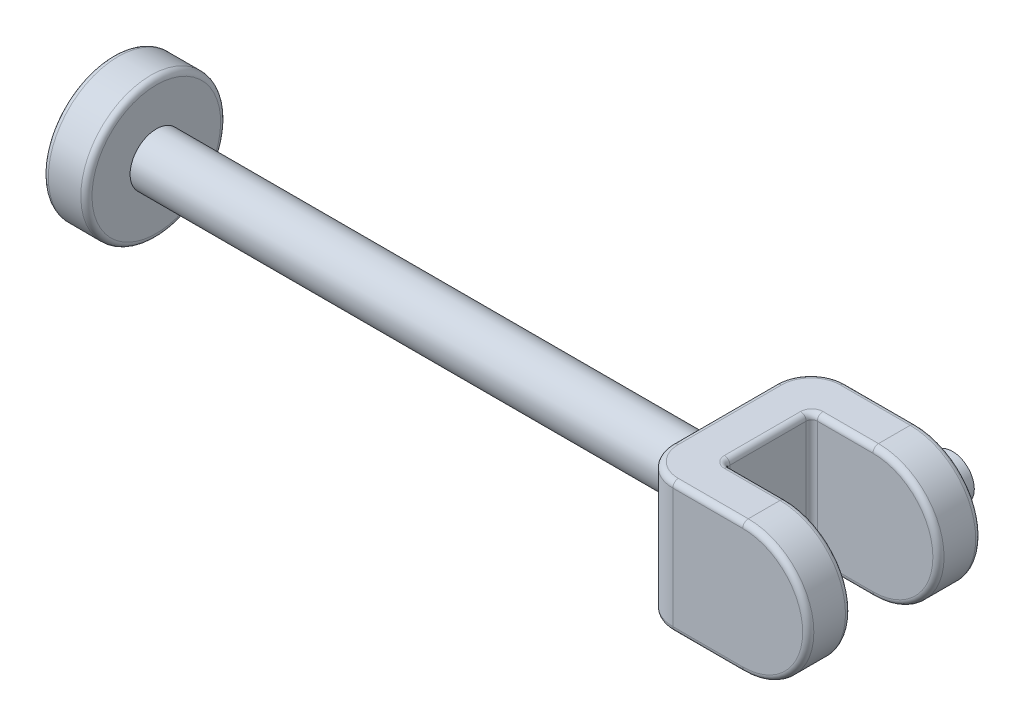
ISO-10303-21;
HEADER;
FILE_DESCRIPTION(('STEP AP214'),'2;1');
FILE_NAME('part.step','',(''),(''),'','','');
FILE_SCHEMA(('AUTOMOTIVE_DESIGN { 1 0 10303 214 1 1 1 1 }'));
ENDSEC;
DATA;
#1=APPLICATION_CONTEXT('core data for automotive mechanical design processes');
#2=APPLICATION_PROTOCOL_DEFINITION('international standard','automotive_design',2000,#1);
#3=PRODUCT_CONTEXT('',#1,'mechanical');
#4=PRODUCT('Part','Part','',(#3));
#5=PRODUCT_RELATED_PRODUCT_CATEGORY('part','',(#4));
#6=PRODUCT_DEFINITION_FORMATION('','',#4);
#7=PRODUCT_DEFINITION_CONTEXT('part definition',#1,'design');
#8=PRODUCT_DEFINITION('design','',#6,#7);
#9=PRODUCT_DEFINITION_SHAPE('','',#8);
#10=(LENGTH_UNIT() NAMED_UNIT(*) SI_UNIT(.MILLI.,.METRE.));
#11=(NAMED_UNIT(*) PLANE_ANGLE_UNIT() SI_UNIT($,.RADIAN.));
#12=(NAMED_UNIT(*) SI_UNIT($,.STERADIAN.) SOLID_ANGLE_UNIT());
#13=UNCERTAINTY_MEASURE_WITH_UNIT(LENGTH_MEASURE(1.E-05),#10,'distance_accuracy_value','');
#14=(GEOMETRIC_REPRESENTATION_CONTEXT(3) GLOBAL_UNCERTAINTY_ASSIGNED_CONTEXT((#13)) GLOBAL_UNIT_ASSIGNED_CONTEXT((#10,
#11,#12)) REPRESENTATION_CONTEXT('',''));
#15=CARTESIAN_POINT('',(0.,0.,0.));
#16=DIRECTION('',(0.,0.,1.));
#17=DIRECTION('',(1.,0.,0.));
#18=AXIS2_PLACEMENT_3D('',#15,#16,#17);
#19=CARTESIAN_POINT('',(52.07,0.,-6.2865));
#20=DIRECTION('',(0.,0.,1.));
#21=DIRECTION('',(1.,0.,0.));
#22=AXIS2_PLACEMENT_3D('',#19,#20,#21);
#23=CYLINDRICAL_SURFACE('',#22,4.7625);
#24=DIRECTION('',(0.,0.,1.));
#25=VECTOR('',#24,1.);
#26=CARTESIAN_POINT('',(52.07,-4.7625,-6.2865));
#27=LINE('',#26,#25);
#28=CARTESIAN_POINT('',(52.07,-4.7625,3.5814));
#29=VERTEX_POINT('',#28);
#30=CARTESIAN_POINT('',(52.07,-4.7625,5.8801));
#31=VERTEX_POINT('',#30);
#32=EDGE_CURVE('E527',#29,#31,#27,.T.);
#33=ORIENTED_EDGE('',*,*,#32,.F.);
#34=CARTESIAN_POINT('',(52.07,0.,3.5814));
#35=DIRECTION('',(0.,0.,1.));
#36=DIRECTION('',(1.,0.,0.));
#37=AXIS2_PLACEMENT_3D('',#34,#35,#36);
#38=CIRCLE('',#37,4.7625);
#39=CARTESIAN_POINT('',(52.07,4.7625,3.5814));
#40=VERTEX_POINT('',#39);
#41=EDGE_CURVE('E294',#29,#40,#38,.T.);
#42=ORIENTED_EDGE('',*,*,#41,.T.);
#43=DIRECTION('',(0.,0.,1.));
#44=VECTOR('',#43,1.);
#45=CARTESIAN_POINT('',(52.07,4.7625,-6.2865));
#46=LINE('',#45,#44);
#47=CARTESIAN_POINT('',(52.07,4.7625,5.8801));
#48=VERTEX_POINT('',#47);
#49=EDGE_CURVE('E526',#40,#48,#46,.T.);
#50=ORIENTED_EDGE('',*,*,#49,.T.);
#51=CARTESIAN_POINT('',(52.07,0.,5.8801));
#52=DIRECTION('',(0.,0.,-1.));
#53=DIRECTION('',(-1.,0.,0.));
#54=AXIS2_PLACEMENT_3D('',#51,#52,#53);
#55=CIRCLE('',#54,4.7625);
#56=EDGE_CURVE('E292',#48,#31,#55,.T.);
#57=ORIENTED_EDGE('',*,*,#56,.T.);
#58=EDGE_LOOP('',(#33,#42,#50,#57));
#59=FACE_BOUND('',#58,.T.);
#60=ADVANCED_FACE('F31',(#59),#23,.T.);
#61=CARTESIAN_POINT('',(54.61,0.,0.));
#62=DIRECTION('',(1.,0.,0.));
#63=DIRECTION('',(0.,1.,0.));
#64=AXIS2_PLACEMENT_3D('',#61,#62,#63);
#65=CYLINDRICAL_SURFACE('',#64,1.905);
#66=CARTESIAN_POINT('',(3.175,0.,0.));
#67=DIRECTION('',(1.,0.,0.));
#68=DIRECTION('',(0.,1.,0.));
#69=AXIS2_PLACEMENT_3D('',#66,#67,#68);
#70=CIRCLE('',#69,1.90499999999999);
#71=CARTESIAN_POINT('',(3.175,1.90499999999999,0.));
#72=VERTEX_POINT('',#71);
#73=EDGE_CURVE('E533',#72,#72,#70,.T.);
#74=ORIENTED_EDGE('',*,*,#73,.T.);
#75=EDGE_LOOP('',(#74));
#76=FACE_BOUND('',#75,.T.);
#77=CARTESIAN_POINT('',(44.45,0.,0.));
#78=DIRECTION('',(1.,0.,0.));
#79=DIRECTION('',(0.,1.,0.));
#80=AXIS2_PLACEMENT_3D('',#77,#78,#79);
#81=CIRCLE('',#80,1.905);
#82=CARTESIAN_POINT('',(44.45,1.905,0.));
#83=VERTEX_POINT('',#82);
#84=EDGE_CURVE('E429',#83,#83,#81,.T.);
#85=ORIENTED_EDGE('',*,*,#84,.F.);
#86=EDGE_LOOP('',(#85));
#87=FACE_BOUND('',#86,.T.);
#88=ADVANCED_FACE('F496',(#76,#87),#65,.T.);
#89=CARTESIAN_POINT('',(3.175,1.90499999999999,0.));
#90=DIRECTION('',(1.,0.,0.));
#91=DIRECTION('',(0.,1.,0.));
#92=AXIS2_PLACEMENT_3D('',#89,#90,#91);
#93=PLANE('',#92);
#94=CARTESIAN_POINT('',(3.175,0.,0.));
#95=DIRECTION('',(1.,0.,0.));
#96=DIRECTION('',(0.,1.,0.));
#97=AXIS2_PLACEMENT_3D('',#94,#95,#96);
#98=CIRCLE('',#97,4.67359999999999);
#99=CARTESIAN_POINT('',(3.175,4.67359999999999,0.));
#100=VERTEX_POINT('',#99);
#101=EDGE_CURVE('E11',#100,#100,#98,.T.);
#102=ORIENTED_EDGE('',*,*,#101,.T.);
#103=EDGE_LOOP('',(#102));
#104=FACE_BOUND('',#103,.T.);
#105=ORIENTED_EDGE('',*,*,#73,.F.);
#106=EDGE_LOOP('',(#105));
#107=FACE_BOUND('',#106,.T.);
#108=ADVANCED_FACE('F503',(#104,#107),#93,.T.);
#109=CARTESIAN_POINT('',(54.61,0.,0.));
#110=DIRECTION('',(1.,0.,0.));
#111=DIRECTION('',(0.,1.,0.));
#112=AXIS2_PLACEMENT_3D('',#109,#110,#111);
#113=CYLINDRICAL_SURFACE('',#112,5.07999999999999);
#114=CARTESIAN_POINT('',(0.406400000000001,0.,0.));
#115=DIRECTION('',(-1.,0.,0.));
#116=DIRECTION('',(0.,-1.,0.));
#117=AXIS2_PLACEMENT_3D('',#114,#115,#116);
#118=CIRCLE('',#117,5.07999999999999);
#119=CARTESIAN_POINT('',(0.406400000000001,-5.07999999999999,0.));
#120=VERTEX_POINT('',#119);
#121=EDGE_CURVE('E335',#120,#120,#118,.F.);
#122=ORIENTED_EDGE('',*,*,#121,.T.);
#123=EDGE_LOOP('',(#122));
#124=FACE_BOUND('',#123,.T.);
#125=CARTESIAN_POINT('',(2.7686,0.,0.));
#126=DIRECTION('',(1.,0.,0.));
#127=DIRECTION('',(0.,1.,0.));
#128=AXIS2_PLACEMENT_3D('',#125,#126,#127);
#129=CIRCLE('',#128,5.07999999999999);
#130=CARTESIAN_POINT('',(2.7686,5.07999999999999,0.));
#131=VERTEX_POINT('',#130);
#132=EDGE_CURVE('E332',#131,#131,#129,.F.);
#133=ORIENTED_EDGE('',*,*,#132,.T.);
#134=EDGE_LOOP('',(#133));
#135=FACE_BOUND('',#134,.T.);
#136=ADVANCED_FACE('F635',(#124,#135),#113,.T.);
#137=CARTESIAN_POINT('',(0.,5.07999999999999,0.));
#138=DIRECTION('',(-1.,0.,0.));
#139=DIRECTION('',(0.,-1.,0.));
#140=AXIS2_PLACEMENT_3D('',#137,#138,#139);
#141=PLANE('',#140);
#142=CARTESIAN_POINT('',(0.,0.,0.));
#143=DIRECTION('',(-1.,0.,0.));
#144=DIRECTION('',(0.,-1.,0.));
#145=AXIS2_PLACEMENT_3D('',#142,#143,#144);
#146=CIRCLE('',#145,4.67359999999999);
#147=CARTESIAN_POINT('',(0.,-4.67359999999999,0.));
#148=VERTEX_POINT('',#147);
#149=EDGE_CURVE('E40',#148,#148,#146,.T.);
#150=ORIENTED_EDGE('',*,*,#149,.T.);
#151=EDGE_LOOP('',(#150));
#152=FACE_BOUND('',#151,.T.);
#153=ADVANCED_FACE('F638',(#152),#141,.T.);
#154=CARTESIAN_POINT('',(44.45,-4.7625,-6.2865));
#155=DIRECTION('',(0.,-1.,0.));
#156=DIRECTION('',(0.,0.,-1.));
#157=AXIS2_PLACEMENT_3D('',#154,#155,#156);
#158=PLANE('',#157);
#159=CARTESIAN_POINT('',(52.07,-4.7625,-5.8801));
#160=VERTEX_POINT('',#159);
#161=CARTESIAN_POINT('',(52.07,-4.7625,-3.5814));
#162=VERTEX_POINT('',#161);
#163=EDGE_CURVE('E520',#160,#162,#27,.T.);
#164=ORIENTED_EDGE('',*,*,#163,.T.);
#165=DIRECTION('',(1.,0.,0.));
#166=VECTOR('',#165,1.);
#167=CARTESIAN_POINT('',(47.625,-4.7625,-3.5814));
#168=LINE('',#167,#166);
#169=CARTESIAN_POINT('',(48.0314,-4.7625,-3.5814));
#170=VERTEX_POINT('',#169);
#171=EDGE_CURVE('E261',#162,#170,#168,.F.);
#172=ORIENTED_EDGE('',*,*,#171,.T.);
#173=CARTESIAN_POINT('',(48.0314,-4.7625,-2.7686));
#174=DIRECTION('',(0.,-1.,0.));
#175=DIRECTION('',(0.,0.,-1.));
#176=AXIS2_PLACEMENT_3D('',#173,#174,#175);
#177=CIRCLE('',#176,0.8128);
#178=CARTESIAN_POINT('',(47.2186,-4.7625,-2.7686));
#179=VERTEX_POINT('',#178);
#180=EDGE_CURVE('E258',#179,#170,#177,.T.);
#181=ORIENTED_EDGE('',*,*,#180,.F.);
#182=DIRECTION('',(0.,0.,-1.));
#183=VECTOR('',#182,1.);
#184=CARTESIAN_POINT('',(47.2186,-4.7625,3.175));
#185=LINE('',#184,#183);
#186=CARTESIAN_POINT('',(47.2186,-4.7625,2.7686));
#187=VERTEX_POINT('',#186);
#188=EDGE_CURVE('E255',#179,#187,#185,.F.);
#189=ORIENTED_EDGE('',*,*,#188,.T.);
#190=CARTESIAN_POINT('',(48.0314,-4.7625,2.7686));
#191=DIRECTION('',(0.,-1.,0.));
#192=DIRECTION('',(0.,0.,-1.));
#193=AXIS2_PLACEMENT_3D('',#190,#191,#192);
#194=CIRCLE('',#193,0.8128);
#195=CARTESIAN_POINT('',(48.0314,-4.7625,3.5814));
#196=VERTEX_POINT('',#195);
#197=EDGE_CURVE('E252',#196,#187,#194,.T.);
#198=ORIENTED_EDGE('',*,*,#197,.F.);
#199=DIRECTION('',(-1.,0.,0.));
#200=VECTOR('',#199,1.);
#201=CARTESIAN_POINT('',(52.07,-4.7625,3.5814));
#202=LINE('',#201,#200);
#203=EDGE_CURVE('E250',#196,#29,#202,.F.);
#204=ORIENTED_EDGE('',*,*,#203,.T.);
#205=ORIENTED_EDGE('',*,*,#32,.T.);
#206=DIRECTION('',(1.,0.,0.));
#207=VECTOR('',#206,1.);
#208=CARTESIAN_POINT('',(46.99,-4.7625,5.8801));
#209=LINE('',#208,#207);
#210=CARTESIAN_POINT('',(46.99,-4.7625,5.8801));
#211=VERTEX_POINT('',#210);
#212=EDGE_CURVE('E240',#31,#211,#209,.F.);
#213=ORIENTED_EDGE('',*,*,#212,.T.);
#214=CARTESIAN_POINT('',(46.99,-4.7625,3.7465));
#215=DIRECTION('',(0.,-1.,0.));
#216=DIRECTION('',(0.,0.,-1.));
#217=AXIS2_PLACEMENT_3D('',#214,#215,#216);
#218=CIRCLE('',#217,2.1336);
#219=CARTESIAN_POINT('',(44.8564,-4.7625,3.7465));
#220=VERTEX_POINT('',#219);
#221=EDGE_CURVE('E242',#211,#220,#218,.T.);
#222=ORIENTED_EDGE('',*,*,#221,.T.);
#223=DIRECTION('',(0.,0.,1.));
#224=VECTOR('',#223,1.);
#225=CARTESIAN_POINT('',(44.8564,-4.7625,-6.2865));
#226=LINE('',#225,#224);
#227=CARTESIAN_POINT('',(44.8564,-4.7625,-3.7465));
#228=VERTEX_POINT('',#227);
#229=EDGE_CURVE('E244',#220,#228,#226,.F.);
#230=ORIENTED_EDGE('',*,*,#229,.T.);
#231=CARTESIAN_POINT('',(46.99,-4.7625,-3.7465));
#232=DIRECTION('',(0.,-1.,0.));
#233=DIRECTION('',(0.,0.,-1.));
#234=AXIS2_PLACEMENT_3D('',#231,#232,#233);
#235=CIRCLE('',#234,2.1336);
#236=CARTESIAN_POINT('',(46.99,-4.7625,-5.8801));
#237=VERTEX_POINT('',#236);
#238=EDGE_CURVE('E246',#228,#237,#235,.T.);
#239=ORIENTED_EDGE('',*,*,#238,.T.);
#240=DIRECTION('',(1.,0.,0.));
#241=VECTOR('',#240,1.);
#242=CARTESIAN_POINT('',(44.45,-4.7625,-5.8801));
#243=LINE('',#242,#241);
#244=EDGE_CURVE('E248',#237,#160,#243,.T.);
#245=ORIENTED_EDGE('',*,*,#244,.T.);
#246=EDGE_LOOP('',(#164,#172,#181,#189,#198,#204,#205,#213,#222,#230,#239,#245));
#247=FACE_BOUND('',#246,.T.);
#248=ADVANCED_FACE('F548',(#247),#158,.T.);
#249=CARTESIAN_POINT('',(44.45,4.7625,-6.2865));
#250=DIRECTION('',(-1.,0.,0.));
#251=DIRECTION('',(0.,0.,1.));
#252=AXIS2_PLACEMENT_3D('',#249,#250,#251);
#253=PLANE('',#252);
#254=ORIENTED_EDGE('',*,*,#84,.T.);
#255=EDGE_LOOP('',(#254));
#256=FACE_BOUND('',#255,.T.);
#257=DIRECTION('',(0.,-1.,0.));
#258=VECTOR('',#257,1.);
#259=CARTESIAN_POINT('',(44.45,4.7625,-3.7465));
#260=LINE('',#259,#258);
#261=CARTESIAN_POINT('',(44.45,4.3561,-3.7465));
#262=VERTEX_POINT('',#261);
#263=CARTESIAN_POINT('',(44.45,-4.3561,-3.7465));
#264=VERTEX_POINT('',#263);
#265=EDGE_CURVE('E423',#262,#264,#260,.T.);
#266=ORIENTED_EDGE('',*,*,#265,.T.);
#267=DIRECTION('',(0.,0.,1.));
#268=VECTOR('',#267,1.);
#269=CARTESIAN_POINT('',(44.45,-4.3561,-6.2865));
#270=LINE('',#269,#268);
#271=CARTESIAN_POINT('',(44.45,-4.3561,3.7465));
#272=VERTEX_POINT('',#271);
#273=EDGE_CURVE('E314',#264,#272,#270,.T.);
#274=ORIENTED_EDGE('',*,*,#273,.T.);
#275=DIRECTION('',(0.,-1.,0.));
#276=VECTOR('',#275,1.);
#277=CARTESIAN_POINT('',(44.45,4.7625,3.7465));
#278=LINE('',#277,#276);
#279=CARTESIAN_POINT('',(44.45,4.3561,3.7465));
#280=VERTEX_POINT('',#279);
#281=EDGE_CURVE('E234',#272,#280,#278,.F.);
#282=ORIENTED_EDGE('',*,*,#281,.T.);
#283=DIRECTION('',(0.,0.,1.));
#284=VECTOR('',#283,1.);
#285=CARTESIAN_POINT('',(44.45,4.3561,-6.2865));
#286=LINE('',#285,#284);
#287=EDGE_CURVE('E312',#280,#262,#286,.F.);
#288=ORIENTED_EDGE('',*,*,#287,.T.);
#289=EDGE_LOOP('',(#266,#274,#282,#288));
#290=FACE_BOUND('',#289,.T.);
#291=ADVANCED_FACE('F437',(#256,#290),#253,.T.);
#292=CARTESIAN_POINT('',(44.45,4.7625,-6.2865));
#293=DIRECTION('',(0.,1.,0.));
#294=DIRECTION('',(0.,0.,1.));
#295=AXIS2_PLACEMENT_3D('',#292,#293,#294);
#296=PLANE('',#295);
#297=CARTESIAN_POINT('',(48.0314,4.7625,-2.7686));
#298=DIRECTION('',(0.,1.,0.));
#299=DIRECTION('',(0.,0.,1.));
#300=AXIS2_PLACEMENT_3D('',#297,#298,#299);
#301=CIRCLE('',#300,0.8128);
#302=CARTESIAN_POINT('',(48.0314,4.7625,-3.5814));
#303=VERTEX_POINT('',#302);
#304=CARTESIAN_POINT('',(47.2186,4.7625,-2.7686));
#305=VERTEX_POINT('',#304);
#306=EDGE_CURVE('E278',#303,#305,#301,.T.);
#307=ORIENTED_EDGE('',*,*,#306,.F.);
#308=DIRECTION('',(-1.,0.,0.));
#309=VECTOR('',#308,1.);
#310=CARTESIAN_POINT('',(52.07,4.7625,-3.5814));
#311=LINE('',#310,#309);
#312=CARTESIAN_POINT('',(52.07,4.7625,-3.5814));
#313=VERTEX_POINT('',#312);
#314=EDGE_CURVE('E281',#303,#313,#311,.F.);
#315=ORIENTED_EDGE('',*,*,#314,.T.);
#316=CARTESIAN_POINT('',(52.07,4.7625,-5.8801));
#317=VERTEX_POINT('',#316);
#318=EDGE_CURVE('E530',#317,#313,#46,.T.);
#319=ORIENTED_EDGE('',*,*,#318,.F.);
#320=DIRECTION('',(-1.,0.,0.));
#321=VECTOR('',#320,1.);
#322=CARTESIAN_POINT('',(44.45,4.7625,-5.8801));
#323=LINE('',#322,#321);
#324=CARTESIAN_POINT('',(46.99,4.7625,-5.8801));
#325=VERTEX_POINT('',#324);
#326=EDGE_CURVE('E263',#317,#325,#323,.T.);
#327=ORIENTED_EDGE('',*,*,#326,.T.);
#328=CARTESIAN_POINT('',(46.99,4.7625,-3.7465));
#329=DIRECTION('',(0.,1.,0.));
#330=DIRECTION('',(0.,0.,1.));
#331=AXIS2_PLACEMENT_3D('',#328,#329,#330);
#332=CIRCLE('',#331,2.1336);
#333=CARTESIAN_POINT('',(44.8564,4.7625,-3.7465));
#334=VERTEX_POINT('',#333);
#335=EDGE_CURVE('E265',#325,#334,#332,.T.);
#336=ORIENTED_EDGE('',*,*,#335,.T.);
#337=DIRECTION('',(0.,0.,1.));
#338=VECTOR('',#337,1.);
#339=CARTESIAN_POINT('',(44.8564,4.7625,-6.2865));
#340=LINE('',#339,#338);
#341=CARTESIAN_POINT('',(44.8564,4.7625,3.7465));
#342=VERTEX_POINT('',#341);
#343=EDGE_CURVE('E267',#334,#342,#340,.T.);
#344=ORIENTED_EDGE('',*,*,#343,.T.);
#345=CARTESIAN_POINT('',(46.99,4.7625,3.7465));
#346=DIRECTION('',(0.,1.,0.));
#347=DIRECTION('',(0.,0.,1.));
#348=AXIS2_PLACEMENT_3D('',#345,#346,#347);
#349=CIRCLE('',#348,2.1336);
#350=CARTESIAN_POINT('',(46.99,4.7625,5.8801));
#351=VERTEX_POINT('',#350);
#352=EDGE_CURVE('E269',#342,#351,#349,.T.);
#353=ORIENTED_EDGE('',*,*,#352,.T.);
#354=DIRECTION('',(-1.,0.,0.));
#355=VECTOR('',#354,1.);
#356=CARTESIAN_POINT('',(52.07,4.7625,5.8801));
#357=LINE('',#356,#355);
#358=EDGE_CURVE('E271',#351,#48,#357,.F.);
#359=ORIENTED_EDGE('',*,*,#358,.T.);
#360=ORIENTED_EDGE('',*,*,#49,.F.);
#361=DIRECTION('',(1.,0.,0.));
#362=VECTOR('',#361,1.);
#363=CARTESIAN_POINT('',(47.625,4.7625,3.5814));
#364=LINE('',#363,#362);
#365=CARTESIAN_POINT('',(48.0314,4.7625,3.5814));
#366=VERTEX_POINT('',#365);
#367=EDGE_CURVE('E275',#40,#366,#364,.F.);
#368=ORIENTED_EDGE('',*,*,#367,.T.);
#369=CARTESIAN_POINT('',(48.0314,4.7625,2.7686));
#370=DIRECTION('',(0.,1.,0.));
#371=DIRECTION('',(0.,0.,1.));
#372=AXIS2_PLACEMENT_3D('',#369,#370,#371);
#373=CIRCLE('',#372,0.8128);
#374=CARTESIAN_POINT('',(47.2186,4.7625,2.7686));
#375=VERTEX_POINT('',#374);
#376=EDGE_CURVE('E273',#375,#366,#373,.T.);
#377=ORIENTED_EDGE('',*,*,#376,.F.);
#378=DIRECTION('',(0.,0.,1.));
#379=VECTOR('',#378,1.);
#380=CARTESIAN_POINT('',(47.2186,4.7625,-3.175));
#381=LINE('',#380,#379);
#382=EDGE_CURVE('E211',#375,#305,#381,.F.);
#383=ORIENTED_EDGE('',*,*,#382,.T.);
#384=EDGE_LOOP('',(#307,#315,#319,#327,#336,#344,#353,#359,#360,#368,#377,#383));
#385=FACE_BOUND('',#384,.T.);
#386=ADVANCED_FACE('F509',(#385),#296,.T.);
#387=ORIENTED_EDGE('',*,*,#163,.F.);
#388=CARTESIAN_POINT('',(52.07,0.,-5.8801));
#389=DIRECTION('',(0.,0.,-1.));
#390=DIRECTION('',(-1.,0.,0.));
#391=AXIS2_PLACEMENT_3D('',#388,#389,#390);
#392=CIRCLE('',#391,4.7625);
#393=EDGE_CURVE('E298',#160,#317,#392,.F.);
#394=ORIENTED_EDGE('',*,*,#393,.T.);
#395=ORIENTED_EDGE('',*,*,#318,.T.);
#396=CARTESIAN_POINT('',(52.07,0.,-3.5814));
#397=DIRECTION('',(0.,0.,-1.));
#398=DIRECTION('',(-1.,0.,0.));
#399=AXIS2_PLACEMENT_3D('',#396,#397,#398);
#400=CIRCLE('',#399,4.7625);
#401=EDGE_CURVE('E296',#313,#162,#400,.T.);
#402=ORIENTED_EDGE('',*,*,#401,.T.);
#403=EDGE_LOOP('',(#387,#394,#395,#402));
#404=FACE_BOUND('',#403,.T.);
#405=ADVANCED_FACE('F499',(#404),#23,.T.);
#406=CARTESIAN_POINT('',(52.07,0.,-6.2865));
#407=DIRECTION('',(0.,0.,-1.));
#408=DIRECTION('',(-1.,0.,0.));
#409=AXIS2_PLACEMENT_3D('',#406,#407,#408);
#410=PLANE('',#409);
#411=CARTESIAN_POINT('',(52.07,0.,-6.2865));
#412=DIRECTION('',(0.,0.,-1.));
#413=DIRECTION('',(-1.,0.,0.));
#414=AXIS2_PLACEMENT_3D('',#411,#412,#413);
#415=CIRCLE('',#414,1.5875);
#416=CARTESIAN_POINT('',(53.6575,0.,-6.2865));
#417=VERTEX_POINT('',#416);
#418=EDGE_CURVE('E424',#417,#417,#415,.T.);
#419=ORIENTED_EDGE('',*,*,#418,.F.);
#420=EDGE_LOOP('',(#419));
#421=FACE_BOUND('',#420,.T.);
#422=CARTESIAN_POINT('',(52.07,0.,-6.2865));
#423=DIRECTION('',(0.,0.,-1.));
#424=DIRECTION('',(-1.,0.,0.));
#425=AXIS2_PLACEMENT_3D('',#422,#423,#424);
#426=CIRCLE('',#425,4.3561);
#427=CARTESIAN_POINT('',(52.07,4.3561,-6.2865));
#428=VERTEX_POINT('',#427);
#429=CARTESIAN_POINT('',(52.07,-4.3561,-6.2865));
#430=VERTEX_POINT('',#429);
#431=EDGE_CURVE('E303',#428,#430,#426,.T.);
#432=ORIENTED_EDGE('',*,*,#431,.T.);
#433=DIRECTION('',(1.,0.,0.));
#434=VECTOR('',#433,1.);
#435=CARTESIAN_POINT('',(52.07,-4.3561,-6.2865));
#436=LINE('',#435,#434);
#437=CARTESIAN_POINT('',(46.99,-4.3561,-6.2865));
#438=VERTEX_POINT('',#437);
#439=EDGE_CURVE('E306',#430,#438,#436,.F.);
#440=ORIENTED_EDGE('',*,*,#439,.T.);
#441=DIRECTION('',(0.,-1.,0.));
#442=VECTOR('',#441,1.);
#443=CARTESIAN_POINT('',(46.99,0.,-6.2865));
#444=LINE('',#443,#442);
#445=CARTESIAN_POINT('',(46.99,4.3561,-6.2865));
#446=VERTEX_POINT('',#445);
#447=EDGE_CURVE('E231',#438,#446,#444,.F.);
#448=ORIENTED_EDGE('',*,*,#447,.T.);
#449=DIRECTION('',(-1.,0.,0.));
#450=VECTOR('',#449,1.);
#451=CARTESIAN_POINT('',(52.07,4.3561,-6.2865));
#452=LINE('',#451,#450);
#453=EDGE_CURVE('E301',#446,#428,#452,.F.);
#454=ORIENTED_EDGE('',*,*,#453,.T.);
#455=EDGE_LOOP('',(#432,#440,#448,#454));
#456=FACE_BOUND('',#455,.T.);
#457=ADVANCED_FACE('F461',(#421,#456),#410,.T.);
#458=CARTESIAN_POINT('',(52.07,0.,6.2865));
#459=DIRECTION('',(0.,0.,-1.));
#460=DIRECTION('',(-1.,0.,0.));
#461=AXIS2_PLACEMENT_3D('',#458,#459,#460);
#462=PLANE('',#461);
#463=DIRECTION('',(0.,-1.,0.));
#464=VECTOR('',#463,1.);
#465=CARTESIAN_POINT('',(46.99,-4.7625,6.2865));
#466=LINE('',#465,#464);
#467=CARTESIAN_POINT('',(46.99,4.3561,6.2865));
#468=VERTEX_POINT('',#467);
#469=CARTESIAN_POINT('',(46.99,-4.3561,6.2865));
#470=VERTEX_POINT('',#469);
#471=EDGE_CURVE('E420',#468,#470,#466,.T.);
#472=ORIENTED_EDGE('',*,*,#471,.T.);
#473=DIRECTION('',(1.,0.,0.));
#474=VECTOR('',#473,1.);
#475=CARTESIAN_POINT('',(52.07,-4.3561,6.2865));
#476=LINE('',#475,#474);
#477=CARTESIAN_POINT('',(52.07,-4.3561,6.2865));
#478=VERTEX_POINT('',#477);
#479=EDGE_CURVE('E324',#470,#478,#476,.T.);
#480=ORIENTED_EDGE('',*,*,#479,.T.);
#481=CARTESIAN_POINT('',(52.07,0.,6.2865));
#482=DIRECTION('',(0.,0.,-1.));
#483=DIRECTION('',(-1.,0.,0.));
#484=AXIS2_PLACEMENT_3D('',#481,#482,#483);
#485=CIRCLE('',#484,4.3561);
#486=CARTESIAN_POINT('',(52.07,4.3561,6.2865));
#487=VERTEX_POINT('',#486);
#488=EDGE_CURVE('E322',#478,#487,#485,.F.);
#489=ORIENTED_EDGE('',*,*,#488,.T.);
#490=DIRECTION('',(-1.,0.,0.));
#491=VECTOR('',#490,1.);
#492=CARTESIAN_POINT('',(46.99,4.3561,6.2865));
#493=LINE('',#492,#491);
#494=EDGE_CURVE('E320',#487,#468,#493,.T.);
#495=ORIENTED_EDGE('',*,*,#494,.T.);
#496=EDGE_LOOP('',(#472,#480,#489,#495));
#497=FACE_BOUND('',#496,.T.);
#498=ADVANCED_FACE('F418',(#497),#462,.F.);
#499=CARTESIAN_POINT('',(52.07,0.,-8.9535));
#500=DIRECTION('',(0.,0.,1.));
#501=DIRECTION('',(1.,0.,0.));
#502=AXIS2_PLACEMENT_3D('',#499,#500,#501);
#503=CYLINDRICAL_SURFACE('',#502,1.5875);
#504=CARTESIAN_POINT('',(52.07,0.,-8.9535));
#505=DIRECTION('',(0.,0.,1.));
#506=DIRECTION('',(1.,0.,0.));
#507=AXIS2_PLACEMENT_3D('',#504,#505,#506);
#508=CIRCLE('',#507,1.5875);
#509=CARTESIAN_POINT('',(53.6575,0.,-8.9535));
#510=VERTEX_POINT('',#509);
#511=EDGE_CURVE('E371',#510,#510,#508,.T.);
#512=CARTESIAN_POINT('',(53.6575,0.,-6.2865));
#513=CARTESIAN_POINT('',(53.6575,0.,-6.31428125));
#514=CARTESIAN_POINT('',(53.6575,0.,-6.3420625));
#515=CARTESIAN_POINT('',(53.6575,0.,-6.397625));
#516=CARTESIAN_POINT('',(53.6575,0.,-6.42540625));
#517=CARTESIAN_POINT('',(53.6575,0.,-6.48096875));
#518=CARTESIAN_POINT('',(53.6575,0.,-6.50875));
#519=CARTESIAN_POINT('',(53.6575,0.,-6.5643125));
#520=CARTESIAN_POINT('',(53.6575,0.,-6.59209375));
#521=CARTESIAN_POINT('',(53.6575,0.,-6.64765625));
#522=CARTESIAN_POINT('',(53.6575,0.,-6.6754375));
#523=CARTESIAN_POINT('',(53.6575,0.,-6.731));
#524=CARTESIAN_POINT('',(53.6575,0.,-6.75878125));
#525=CARTESIAN_POINT('',(53.6575,0.,-6.81434375));
#526=CARTESIAN_POINT('',(53.6575,0.,-6.842125));
#527=CARTESIAN_POINT('',(53.6575,0.,-6.8976875));
#528=CARTESIAN_POINT('',(53.6575,0.,-6.92546875));
#529=CARTESIAN_POINT('',(53.6575,0.,-6.98103125));
#530=CARTESIAN_POINT('',(53.6575,0.,-7.0088125));
#531=CARTESIAN_POINT('',(53.6575,0.,-7.064375));
#532=CARTESIAN_POINT('',(53.6575,0.,-7.09215625));
#533=CARTESIAN_POINT('',(53.6575,0.,-7.14771875));
#534=CARTESIAN_POINT('',(53.6575,0.,-7.1755));
#535=CARTESIAN_POINT('',(53.6575,0.,-7.2310625));
#536=CARTESIAN_POINT('',(53.6575,0.,-7.25884375));
#537=CARTESIAN_POINT('',(53.6575,0.,-7.31440625));
#538=CARTESIAN_POINT('',(53.6575,0.,-7.3421875));
#539=CARTESIAN_POINT('',(53.6575,0.,-7.39775));
#540=CARTESIAN_POINT('',(53.6575,0.,-7.42553125));
#541=CARTESIAN_POINT('',(53.6575,0.,-7.48109375));
#542=CARTESIAN_POINT('',(53.6575,0.,-7.508875));
#543=CARTESIAN_POINT('',(53.6575,0.,-7.5644375));
#544=CARTESIAN_POINT('',(53.6575,0.,-7.59221875));
#545=CARTESIAN_POINT('',(53.6575,0.,-7.64778125));
#546=CARTESIAN_POINT('',(53.6575,0.,-7.6755625));
#547=CARTESIAN_POINT('',(53.6575,0.,-7.731125));
#548=CARTESIAN_POINT('',(53.6575,0.,-7.75890625));
#549=CARTESIAN_POINT('',(53.6575,0.,-7.81446875));
#550=CARTESIAN_POINT('',(53.6575,0.,-7.84225));
#551=CARTESIAN_POINT('',(53.6575,0.,-7.8978125));
#552=CARTESIAN_POINT('',(53.6575,0.,-7.92559375));
#553=CARTESIAN_POINT('',(53.6575,0.,-7.98115625));
#554=CARTESIAN_POINT('',(53.6575,0.,-8.0089375));
#555=CARTESIAN_POINT('',(53.6575,0.,-8.0645));
#556=CARTESIAN_POINT('',(53.6575,0.,-8.09228125));
#557=CARTESIAN_POINT('',(53.6575,0.,-8.14784375));
#558=CARTESIAN_POINT('',(53.6575,0.,-8.175625));
#559=CARTESIAN_POINT('',(53.6575,0.,-8.2311875));
#560=CARTESIAN_POINT('',(53.6575,0.,-8.25896875));
#561=CARTESIAN_POINT('',(53.6575,0.,-8.31453125));
#562=CARTESIAN_POINT('',(53.6575,0.,-8.3423125));
#563=CARTESIAN_POINT('',(53.6575,0.,-8.397875));
#564=CARTESIAN_POINT('',(53.6575,0.,-8.42565625));
#565=CARTESIAN_POINT('',(53.6575,0.,-8.48121875));
#566=CARTESIAN_POINT('',(53.6575,0.,-8.509));
#567=CARTESIAN_POINT('',(53.6575,0.,-8.5645625));
#568=CARTESIAN_POINT('',(53.6575,0.,-8.59234375));
#569=CARTESIAN_POINT('',(53.6575,0.,-8.64790625));
#570=CARTESIAN_POINT('',(53.6575,0.,-8.6756875));
#571=CARTESIAN_POINT('',(53.6575,0.,-8.73125));
#572=CARTESIAN_POINT('',(53.6575,0.,-8.75903125));
#573=CARTESIAN_POINT('',(53.6575,0.,-8.81459375));
#574=CARTESIAN_POINT('',(53.6575,0.,-8.842375));
#575=CARTESIAN_POINT('',(53.6575,0.,-8.8979375));
#576=CARTESIAN_POINT('',(53.6575,0.,-8.92571875));
#577=CARTESIAN_POINT('',(53.6575,0.,-8.9535));
#578=B_SPLINE_CURVE_WITH_KNOTS('',3,(#512,#513,#514,#515,#516,#517,#518,#519,#520,#521,#522,
#523,#524,#525,#526,#527,#528,#529,#530,#531,#532,#533,#534,#535,#536,#537,#538,#539,#540,#541,
#542,#543,#544,#545,#546,#547,#548,#549,#550,#551,#552,#553,#554,#555,#556,#557,#558,#559,#560,
#561,#562,#563,#564,#565,#566,#567,#568,#569,#570,#571,#572,#573,#574,#575,#576,#577),
.UNSPECIFIED.,.F.,.F.,(4,2,2,2,2,2,2,2,2,2,2,2,2,2,2,2,2,2,2,2,2,2,2,2,2,2,2,2,2,2,2,2,4),(0.,
0.083343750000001,0.1666875,0.250031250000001,0.333375,0.416718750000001,0.500062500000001,
0.583406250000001,0.666750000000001,0.750093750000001,0.833437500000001,0.916781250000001,
1.000125,1.08346875,1.1668125,1.25015625,1.3335,1.41684375,1.5001875,1.58353125,1.666875,
1.75021875,1.8335625,1.91690625,2.00025,2.08359375,2.1669375,2.25028125,2.333625,2.41696875,
2.5003125,2.58365625,2.667),.UNSPECIFIED.);
#579=EDGE_CURVE('BSEAM491',#417,#510,#578,.T.);
#580=ORIENTED_EDGE('',*,*,#418,.T.);
#581=ORIENTED_EDGE('',*,*,#511,.T.);
#582=ORIENTED_EDGE('',*,*,#579,.T.);
#583=ORIENTED_EDGE('',*,*,#579,.F.);
#584=EDGE_LOOP('',(#580,#582,#581,#583));
#585=FACE_BOUND('',#584,.T.);
#586=ADVANCED_FACE('F491',(#585),#503,.T.);
#587=CARTESIAN_POINT('',(52.07,0.,-8.9535));
#588=DIRECTION('',(0.,0.,1.));
#589=DIRECTION('',(1.,0.,0.));
#590=AXIS2_PLACEMENT_3D('',#587,#588,#589);
#591=PLANE('',#590);
#592=ORIENTED_EDGE('',*,*,#511,.F.);
#593=EDGE_LOOP('',(#592));
#594=FACE_BOUND('',#593,.T.);
#595=ADVANCED_FACE('F483',(#594),#591,.F.);
#596=CARTESIAN_POINT('',(46.99,0.,3.7465));
#597=DIRECTION('',(0.,1.,0.));
#598=DIRECTION('',(0.,0.,1.));
#599=AXIS2_PLACEMENT_3D('',#596,#597,#598);
#600=CYLINDRICAL_SURFACE('',#599,2.54);
#601=ORIENTED_EDGE('',*,*,#281,.F.);
#602=CARTESIAN_POINT('',(46.99,-4.3561,3.7465));
#603=DIRECTION('',(0.,-1.,0.));
#604=DIRECTION('',(0.,0.,-1.));
#605=AXIS2_PLACEMENT_3D('',#602,#603,#604);
#606=CIRCLE('',#605,2.54);
#607=EDGE_CURVE('E318',#272,#470,#606,.F.);
#608=ORIENTED_EDGE('',*,*,#607,.T.);
#609=ORIENTED_EDGE('',*,*,#471,.F.);
#610=CARTESIAN_POINT('',(46.99,4.3561,3.7465));
#611=DIRECTION('',(0.,1.,0.));
#612=DIRECTION('',(0.,0.,1.));
#613=AXIS2_PLACEMENT_3D('',#610,#611,#612);
#614=CIRCLE('',#613,2.54);
#615=EDGE_CURVE('E316',#468,#280,#614,.F.);
#616=ORIENTED_EDGE('',*,*,#615,.T.);
#617=EDGE_LOOP('',(#601,#608,#609,#616));
#618=FACE_BOUND('',#617,.T.);
#619=ADVANCED_FACE('F481',(#618),#600,.T.);
#620=CARTESIAN_POINT('',(46.99,4.7625,-3.7465));
#621=DIRECTION('',(0.,-1.,0.));
#622=DIRECTION('',(0.,0.,-1.));
#623=AXIS2_PLACEMENT_3D('',#620,#621,#622);
#624=CYLINDRICAL_SURFACE('',#623,2.54);
#625=ORIENTED_EDGE('',*,*,#447,.F.);
#626=CARTESIAN_POINT('',(46.99,-4.3561,-3.7465));
#627=DIRECTION('',(0.,-1.,0.));
#628=DIRECTION('',(0.,0.,-1.));
#629=AXIS2_PLACEMENT_3D('',#626,#627,#628);
#630=CIRCLE('',#629,2.54);
#631=EDGE_CURVE('E310',#438,#264,#630,.F.);
#632=ORIENTED_EDGE('',*,*,#631,.T.);
#633=ORIENTED_EDGE('',*,*,#265,.F.);
#634=CARTESIAN_POINT('',(46.99,4.3561,-3.7465));
#635=DIRECTION('',(0.,1.,0.));
#636=DIRECTION('',(0.,0.,1.));
#637=AXIS2_PLACEMENT_3D('',#634,#635,#636);
#638=CIRCLE('',#637,2.54);
#639=EDGE_CURVE('E308',#262,#446,#638,.F.);
#640=ORIENTED_EDGE('',*,*,#639,.T.);
#641=EDGE_LOOP('',(#625,#632,#633,#640));
#642=FACE_BOUND('',#641,.T.);
#643=ADVANCED_FACE('F458',(#642),#624,.T.);
#644=CARTESIAN_POINT('',(60.96,-5.08,3.175));
#645=DIRECTION('',(0.,0.,1.));
#646=DIRECTION('',(1.,0.,0.));
#647=AXIS2_PLACEMENT_3D('',#644,#645,#646);
#648=PLANE('',#647);
#649=DIRECTION('',(1.,0.,0.));
#650=VECTOR('',#649,1.);
#651=CARTESIAN_POINT('',(52.07,4.3561,3.175));
#652=LINE('',#651,#650);
#653=CARTESIAN_POINT('',(48.0314,4.3561,3.175));
#654=VERTEX_POINT('',#653);
#655=CARTESIAN_POINT('',(52.07,4.3561,3.175));
#656=VERTEX_POINT('',#655);
#657=EDGE_CURVE('E285',#654,#656,#652,.T.);
#658=ORIENTED_EDGE('',*,*,#657,.T.);
#659=CARTESIAN_POINT('',(52.07,0.,3.175));
#660=DIRECTION('',(0.,0.,1.));
#661=DIRECTION('',(1.,0.,0.));
#662=AXIS2_PLACEMENT_3D('',#659,#660,#661);
#663=CIRCLE('',#662,4.3561);
#664=CARTESIAN_POINT('',(52.07,-4.3561,3.175));
#665=VERTEX_POINT('',#664);
#666=EDGE_CURVE('E289',#656,#665,#663,.F.);
#667=ORIENTED_EDGE('',*,*,#666,.T.);
#668=DIRECTION('',(-1.,0.,0.));
#669=VECTOR('',#668,1.);
#670=CARTESIAN_POINT('',(47.625,-4.3561,3.175));
#671=LINE('',#670,#669);
#672=CARTESIAN_POINT('',(48.0314,-4.3561,3.175));
#673=VERTEX_POINT('',#672);
#674=EDGE_CURVE('E287',#665,#673,#671,.T.);
#675=ORIENTED_EDGE('',*,*,#674,.T.);
#676=DIRECTION('',(0.,1.,0.));
#677=VECTOR('',#676,1.);
#678=CARTESIAN_POINT('',(48.0314,4.7625,3.175));
#679=LINE('',#678,#677);
#680=EDGE_CURVE('E283',#673,#654,#679,.T.);
#681=ORIENTED_EDGE('',*,*,#680,.T.);
#682=EDGE_LOOP('',(#658,#667,#675,#681));
#683=FACE_BOUND('',#682,.T.);
#684=ADVANCED_FACE('F489',(#683),#648,.F.);
#685=CARTESIAN_POINT('',(47.625,-5.08,-3.175));
#686=DIRECTION('',(-1.,0.,0.));
#687=DIRECTION('',(0.,-1.,0.));
#688=AXIS2_PLACEMENT_3D('',#685,#686,#687);
#689=PLANE('',#688);
#690=DIRECTION('',(0.,0.,-1.));
#691=VECTOR('',#690,1.);
#692=CARTESIAN_POINT('',(47.625,-4.3561,-3.175));
#693=LINE('',#692,#691);
#694=CARTESIAN_POINT('',(47.625,-4.3561,2.7686));
#695=VERTEX_POINT('',#694);
#696=CARTESIAN_POINT('',(47.625,-4.3561,-2.7686));
#697=VERTEX_POINT('',#696);
#698=EDGE_CURVE('E204',#695,#697,#693,.T.);
#699=ORIENTED_EDGE('',*,*,#698,.T.);
#700=DIRECTION('',(0.,1.,0.));
#701=VECTOR('',#700,1.);
#702=CARTESIAN_POINT('',(47.625,4.7625,-2.7686));
#703=LINE('',#702,#701);
#704=CARTESIAN_POINT('',(47.625,4.3561,-2.7686));
#705=VERTEX_POINT('',#704);
#706=EDGE_CURVE('E200',#697,#705,#703,.T.);
#707=ORIENTED_EDGE('',*,*,#706,.T.);
#708=DIRECTION('',(0.,0.,1.));
#709=VECTOR('',#708,1.);
#710=CARTESIAN_POINT('',(47.625,4.3561,3.175));
#711=LINE('',#710,#709);
#712=CARTESIAN_POINT('',(47.625,4.3561,2.7686));
#713=VERTEX_POINT('',#712);
#714=EDGE_CURVE('E192',#705,#713,#711,.T.);
#715=ORIENTED_EDGE('',*,*,#714,.T.);
#716=DIRECTION('',(0.,1.,0.));
#717=VECTOR('',#716,1.);
#718=CARTESIAN_POINT('',(47.625,-4.7625,2.7686));
#719=LINE('',#718,#717);
#720=EDGE_CURVE('E197',#713,#695,#719,.F.);
#721=ORIENTED_EDGE('',*,*,#720,.T.);
#722=EDGE_LOOP('',(#699,#707,#715,#721));
#723=FACE_BOUND('',#722,.T.);
#724=ADVANCED_FACE('F195',(#723),#689,.F.);
#725=CARTESIAN_POINT('',(60.96,-5.08,-3.175));
#726=DIRECTION('',(0.,0.,-1.));
#727=DIRECTION('',(-1.,0.,0.));
#728=AXIS2_PLACEMENT_3D('',#725,#726,#727);
#729=PLANE('',#728);
#730=DIRECTION('',(-1.,0.,0.));
#731=VECTOR('',#730,1.);
#732=CARTESIAN_POINT('',(47.625,4.3561,-3.175));
#733=LINE('',#732,#731);
#734=CARTESIAN_POINT('',(52.07,4.3561,-3.175));
#735=VERTEX_POINT('',#734);
#736=CARTESIAN_POINT('',(48.0314,4.3561,-3.175));
#737=VERTEX_POINT('',#736);
#738=EDGE_CURVE('E48',#735,#737,#733,.T.);
#739=ORIENTED_EDGE('',*,*,#738,.T.);
#740=DIRECTION('',(0.,1.,0.));
#741=VECTOR('',#740,1.);
#742=CARTESIAN_POINT('',(48.0314,-4.7625,-3.175));
#743=LINE('',#742,#741);
#744=CARTESIAN_POINT('',(48.0314,-4.3561,-3.175));
#745=VERTEX_POINT('',#744);
#746=EDGE_CURVE('E330',#737,#745,#743,.F.);
#747=ORIENTED_EDGE('',*,*,#746,.T.);
#748=DIRECTION('',(1.,0.,0.));
#749=VECTOR('',#748,1.);
#750=CARTESIAN_POINT('',(52.07,-4.3561,-3.175));
#751=LINE('',#750,#749);
#752=CARTESIAN_POINT('',(52.07,-4.3561,-3.175));
#753=VERTEX_POINT('',#752);
#754=EDGE_CURVE('E326',#745,#753,#751,.T.);
#755=ORIENTED_EDGE('',*,*,#754,.T.);
#756=CARTESIAN_POINT('',(52.07,0.,-3.175));
#757=DIRECTION('',(0.,0.,-1.));
#758=DIRECTION('',(-1.,0.,0.));
#759=AXIS2_PLACEMENT_3D('',#756,#757,#758);
#760=CIRCLE('',#759,4.3561);
#761=EDGE_CURVE('E53',#753,#735,#760,.F.);
#762=ORIENTED_EDGE('',*,*,#761,.T.);
#763=EDGE_LOOP('',(#739,#747,#755,#762));
#764=FACE_BOUND('',#763,.T.);
#765=ADVANCED_FACE('F595',(#764),#729,.F.);
#766=CARTESIAN_POINT('',(60.96,4.3561,3.5814));
#767=DIRECTION('',(-1.,0.,0.));
#768=DIRECTION('',(0.,0.,1.));
#769=AXIS2_PLACEMENT_3D('',#766,#767,#768);
#770=CYLINDRICAL_SURFACE('',#769,0.4064);
#771=CARTESIAN_POINT('',(48.0314,4.3561,3.5814));
#772=DIRECTION('',(-1.,0.,0.));
#773=DIRECTION('',(0.,0.,1.));
#774=AXIS2_PLACEMENT_3D('',#771,#772,#773);
#775=CIRCLE('',#774,0.4064);
#776=EDGE_CURVE('E214',#366,#654,#775,.T.);
#777=ORIENTED_EDGE('',*,*,#776,.F.);
#778=ORIENTED_EDGE('',*,*,#367,.F.);
#779=CARTESIAN_POINT('',(52.07,4.3561,3.5814));
#780=DIRECTION('',(1.,0.,0.));
#781=DIRECTION('',(0.,0.,-1.));
#782=AXIS2_PLACEMENT_3D('',#779,#780,#781);
#783=CIRCLE('',#782,0.4064);
#784=EDGE_CURVE('E368',#656,#40,#783,.T.);
#785=ORIENTED_EDGE('',*,*,#784,.F.);
#786=ORIENTED_EDGE('',*,*,#657,.F.);
#787=EDGE_LOOP('',(#777,#778,#785,#786));
#788=FACE_BOUND('',#787,.T.);
#789=ADVANCED_FACE('F568',(#788),#770,.T.);
#790=CARTESIAN_POINT('',(47.2186,4.3561,-3.175));
#791=DIRECTION('',(0.,0.,-1.));
#792=DIRECTION('',(-1.,0.,0.));
#793=AXIS2_PLACEMENT_3D('',#790,#791,#792);
#794=CYLINDRICAL_SURFACE('',#793,0.4064);
#795=CARTESIAN_POINT('',(47.2186,4.3561,-2.7686));
#796=DIRECTION('',(0.,0.,-1.));
#797=DIRECTION('',(-1.,0.,0.));
#798=AXIS2_PLACEMENT_3D('',#795,#796,#797);
#799=CIRCLE('',#798,0.4064);
#800=EDGE_CURVE('E215',#305,#705,#799,.T.);
#801=ORIENTED_EDGE('',*,*,#800,.F.);
#802=ORIENTED_EDGE('',*,*,#382,.F.);
#803=CARTESIAN_POINT('',(47.2186,4.3561,2.7686));
#804=DIRECTION('',(0.,0.,1.));
#805=DIRECTION('',(1.,0.,0.));
#806=AXIS2_PLACEMENT_3D('',#803,#804,#805);
#807=CIRCLE('',#806,0.4064);
#808=EDGE_CURVE('E208',#713,#375,#807,.T.);
#809=ORIENTED_EDGE('',*,*,#808,.F.);
#810=ORIENTED_EDGE('',*,*,#714,.F.);
#811=EDGE_LOOP('',(#801,#802,#809,#810));
#812=FACE_BOUND('',#811,.T.);
#813=ADVANCED_FACE('F210',(#812),#794,.T.);
#814=CARTESIAN_POINT('',(60.96,4.3561,-3.5814));
#815=DIRECTION('',(1.,0.,0.));
#816=DIRECTION('',(0.,0.,-1.));
#817=AXIS2_PLACEMENT_3D('',#814,#815,#816);
#818=CYLINDRICAL_SURFACE('',#817,0.4064);
#819=CARTESIAN_POINT('',(52.07,4.3561,-3.5814));
#820=DIRECTION('',(1.,0.,0.));
#821=DIRECTION('',(0.,0.,-1.));
#822=AXIS2_PLACEMENT_3D('',#819,#820,#821);
#823=CIRCLE('',#822,0.4064);
#824=EDGE_CURVE('E360',#313,#735,#823,.T.);
#825=ORIENTED_EDGE('',*,*,#824,.F.);
#826=ORIENTED_EDGE('',*,*,#314,.F.);
#827=CARTESIAN_POINT('',(48.0314,4.3561,-3.5814));
#828=DIRECTION('',(-1.,0.,0.));
#829=DIRECTION('',(0.,0.,1.));
#830=AXIS2_PLACEMENT_3D('',#827,#828,#829);
#831=CIRCLE('',#830,0.4064);
#832=EDGE_CURVE('E363',#737,#303,#831,.T.);
#833=ORIENTED_EDGE('',*,*,#832,.F.);
#834=ORIENTED_EDGE('',*,*,#738,.F.);
#835=EDGE_LOOP('',(#825,#826,#833,#834));
#836=FACE_BOUND('',#835,.T.);
#837=ADVANCED_FACE('F540',(#836),#818,.T.);
#838=CARTESIAN_POINT('',(52.07,0.,3.5814));
#839=DIRECTION('',(0.,0.,1.));
#840=DIRECTION('',(1.,0.,0.));
#841=AXIS2_PLACEMENT_3D('',#838,#839,#840);
#842=TOROIDAL_SURFACE('',#841,4.3561,0.4064);
#843=ORIENTED_EDGE('',*,*,#784,.T.);
#844=ORIENTED_EDGE('',*,*,#41,.F.);
#845=CARTESIAN_POINT('',(52.07,-4.3561,3.5814));
#846=DIRECTION('',(-1.,0.,0.));
#847=DIRECTION('',(0.,0.,1.));
#848=AXIS2_PLACEMENT_3D('',#845,#846,#847);
#849=CIRCLE('',#848,0.4064);
#850=EDGE_CURVE('E224',#665,#29,#849,.T.);
#851=ORIENTED_EDGE('',*,*,#850,.F.);
#852=ORIENTED_EDGE('',*,*,#666,.F.);
#853=EDGE_LOOP('',(#843,#844,#851,#852));
#854=FACE_BOUND('',#853,.T.);
#855=ADVANCED_FACE('F580',(#854),#842,.T.);
#856=CARTESIAN_POINT('',(48.0314,4.3561,2.7686));
#857=DIRECTION('',(0.,1.,0.));
#858=DIRECTION('',(0.,0.,1.));
#859=AXIS2_PLACEMENT_3D('',#856,#857,#858);
#860=TOROIDAL_SURFACE('',#859,0.8128,0.4064);
#861=ORIENTED_EDGE('',*,*,#376,.T.);
#862=ORIENTED_EDGE('',*,*,#776,.T.);
#863=CARTESIAN_POINT('',(48.0314,4.3561,2.7686));
#864=DIRECTION('',(0.,1.,0.));
#865=DIRECTION('',(0.,0.,1.));
#866=AXIS2_PLACEMENT_3D('',#863,#864,#865);
#867=CIRCLE('',#866,0.4064);
#868=EDGE_CURVE('E219',#713,#654,#867,.T.);
#869=ORIENTED_EDGE('',*,*,#868,.F.);
#870=ORIENTED_EDGE('',*,*,#808,.T.);
#871=EDGE_LOOP('',(#861,#862,#869,#870));
#872=FACE_BOUND('',#871,.T.);
#873=ADVANCED_FACE('F220',(#872),#860,.T.);
#874=CARTESIAN_POINT('',(48.0314,4.3561,-2.7686));
#875=DIRECTION('',(0.,1.,0.));
#876=DIRECTION('',(0.,0.,1.));
#877=AXIS2_PLACEMENT_3D('',#874,#875,#876);
#878=TOROIDAL_SURFACE('',#877,0.8128,0.4064);
#879=ORIENTED_EDGE('',*,*,#306,.T.);
#880=ORIENTED_EDGE('',*,*,#800,.T.);
#881=CARTESIAN_POINT('',(48.0314,4.3561,-2.7686));
#882=DIRECTION('',(0.,1.,0.));
#883=DIRECTION('',(0.,0.,1.));
#884=AXIS2_PLACEMENT_3D('',#881,#882,#883);
#885=CIRCLE('',#884,0.4064);
#886=EDGE_CURVE('E225',#737,#705,#885,.T.);
#887=ORIENTED_EDGE('',*,*,#886,.F.);
#888=ORIENTED_EDGE('',*,*,#832,.T.);
#889=EDGE_LOOP('',(#879,#880,#887,#888));
#890=FACE_BOUND('',#889,.T.);
#891=ADVANCED_FACE('F562',(#890),#878,.T.);
#892=CARTESIAN_POINT('',(52.07,0.,-3.5814));
#893=DIRECTION('',(0.,0.,-1.));
#894=DIRECTION('',(-1.,0.,0.));
#895=AXIS2_PLACEMENT_3D('',#892,#893,#894);
#896=TOROIDAL_SURFACE('',#895,4.3561,0.4064);
#897=ORIENTED_EDGE('',*,*,#824,.T.);
#898=ORIENTED_EDGE('',*,*,#761,.F.);
#899=CARTESIAN_POINT('',(52.07,-4.3561,-3.5814));
#900=DIRECTION('',(-1.,0.,0.));
#901=DIRECTION('',(0.,0.,1.));
#902=AXIS2_PLACEMENT_3D('',#899,#900,#901);
#903=CIRCLE('',#902,0.4064);
#904=EDGE_CURVE('E353',#162,#753,#903,.T.);
#905=ORIENTED_EDGE('',*,*,#904,.F.);
#906=ORIENTED_EDGE('',*,*,#401,.F.);
#907=EDGE_LOOP('',(#897,#898,#905,#906));
#908=FACE_BOUND('',#907,.T.);
#909=ADVANCED_FACE('F542',(#908),#896,.T.);
#910=CARTESIAN_POINT('',(60.96,-4.3561,3.5814));
#911=DIRECTION('',(1.,0.,0.));
#912=DIRECTION('',(0.,0.,-1.));
#913=AXIS2_PLACEMENT_3D('',#910,#911,#912);
#914=CYLINDRICAL_SURFACE('',#913,0.4064);
#915=ORIENTED_EDGE('',*,*,#850,.T.);
#916=ORIENTED_EDGE('',*,*,#203,.F.);
#917=CARTESIAN_POINT('',(48.0314,-4.3561,3.5814));
#918=DIRECTION('',(-1.,0.,0.));
#919=DIRECTION('',(0.,0.,1.));
#920=AXIS2_PLACEMENT_3D('',#917,#918,#919);
#921=CIRCLE('',#920,0.4064);
#922=EDGE_CURVE('E350',#673,#196,#921,.T.);
#923=ORIENTED_EDGE('',*,*,#922,.F.);
#924=ORIENTED_EDGE('',*,*,#674,.F.);
#925=EDGE_LOOP('',(#915,#916,#923,#924));
#926=FACE_BOUND('',#925,.T.);
#927=ADVANCED_FACE('F574',(#926),#914,.T.);
#928=CARTESIAN_POINT('',(48.0314,-5.08,2.7686));
#929=DIRECTION('',(0.,-1.,0.));
#930=DIRECTION('',(1.,0.,0.));
#931=AXIS2_PLACEMENT_3D('',#928,#929,#930);
#932=CYLINDRICAL_SURFACE('',#931,0.4064);
#933=ORIENTED_EDGE('',*,*,#868,.T.);
#934=ORIENTED_EDGE('',*,*,#680,.F.);
#935=CARTESIAN_POINT('',(48.0314,-4.3561,2.7686));
#936=DIRECTION('',(0.,-1.,0.));
#937=DIRECTION('',(0.,0.,-1.));
#938=AXIS2_PLACEMENT_3D('',#935,#936,#937);
#939=CIRCLE('',#938,0.4064);
#940=EDGE_CURVE('E229',#695,#673,#939,.F.);
#941=ORIENTED_EDGE('',*,*,#940,.F.);
#942=ORIENTED_EDGE('',*,*,#720,.F.);
#943=EDGE_LOOP('',(#933,#934,#941,#942));
#944=FACE_BOUND('',#943,.T.);
#945=ADVANCED_FACE('F227',(#944),#932,.F.);
#946=CARTESIAN_POINT('',(48.0314,-5.08,-2.7686));
#947=DIRECTION('',(0.,-1.,0.));
#948=DIRECTION('',(1.,0.,0.));
#949=AXIS2_PLACEMENT_3D('',#946,#947,#948);
#950=CYLINDRICAL_SURFACE('',#949,0.4064);
#951=ORIENTED_EDGE('',*,*,#886,.T.);
#952=ORIENTED_EDGE('',*,*,#706,.F.);
#953=CARTESIAN_POINT('',(48.0314,-4.3561,-2.7686));
#954=DIRECTION('',(0.,-1.,0.));
#955=DIRECTION('',(0.,0.,-1.));
#956=AXIS2_PLACEMENT_3D('',#953,#954,#955);
#957=CIRCLE('',#956,0.4064);
#958=EDGE_CURVE('E346',#745,#697,#957,.F.);
#959=ORIENTED_EDGE('',*,*,#958,.F.);
#960=ORIENTED_EDGE('',*,*,#746,.F.);
#961=EDGE_LOOP('',(#951,#952,#959,#960));
#962=FACE_BOUND('',#961,.T.);
#963=ADVANCED_FACE('F559',(#962),#950,.F.);
#964=CARTESIAN_POINT('',(60.96,-4.3561,-3.5814));
#965=DIRECTION('',(-1.,0.,0.));
#966=DIRECTION('',(0.,0.,1.));
#967=AXIS2_PLACEMENT_3D('',#964,#965,#966);
#968=CYLINDRICAL_SURFACE('',#967,0.4064);
#969=ORIENTED_EDGE('',*,*,#904,.T.);
#970=ORIENTED_EDGE('',*,*,#754,.F.);
#971=CARTESIAN_POINT('',(48.0314,-4.3561,-3.5814));
#972=DIRECTION('',(-1.,0.,0.));
#973=DIRECTION('',(0.,0.,1.));
#974=AXIS2_PLACEMENT_3D('',#971,#972,#973);
#975=CIRCLE('',#974,0.4064);
#976=EDGE_CURVE('E344',#170,#745,#975,.T.);
#977=ORIENTED_EDGE('',*,*,#976,.F.);
#978=ORIENTED_EDGE('',*,*,#171,.F.);
#979=EDGE_LOOP('',(#969,#970,#977,#978));
#980=FACE_BOUND('',#979,.T.);
#981=ADVANCED_FACE('F547',(#980),#968,.T.);
#982=CARTESIAN_POINT('',(48.0314,-4.3561,2.7686));
#983=DIRECTION('',(0.,-1.,0.));
#984=DIRECTION('',(0.,0.,-1.));
#985=AXIS2_PLACEMENT_3D('',#982,#983,#984);
#986=TOROIDAL_SURFACE('',#985,0.8128,0.4064);
#987=ORIENTED_EDGE('',*,*,#922,.T.);
#988=ORIENTED_EDGE('',*,*,#197,.T.);
#989=CARTESIAN_POINT('',(47.2186,-4.3561,2.7686));
#990=DIRECTION('',(0.,0.,1.));
#991=DIRECTION('',(1.,0.,0.));
#992=AXIS2_PLACEMENT_3D('',#989,#990,#991);
#993=CIRCLE('',#992,0.4064);
#994=EDGE_CURVE('E342',#695,#187,#993,.F.);
#995=ORIENTED_EDGE('',*,*,#994,.F.);
#996=ORIENTED_EDGE('',*,*,#940,.T.);
#997=EDGE_LOOP('',(#987,#988,#995,#996));
#998=FACE_BOUND('',#997,.T.);
#999=ADVANCED_FACE('F577',(#998),#986,.T.);
#1000=CARTESIAN_POINT('',(48.0314,-4.3561,-2.7686));
#1001=DIRECTION('',(0.,-1.,0.));
#1002=DIRECTION('',(0.,0.,-1.));
#1003=AXIS2_PLACEMENT_3D('',#1000,#1001,#1002);
#1004=TOROIDAL_SURFACE('',#1003,0.8128,0.4064);
#1005=ORIENTED_EDGE('',*,*,#976,.T.);
#1006=ORIENTED_EDGE('',*,*,#958,.T.);
#1007=CARTESIAN_POINT('',(47.2186,-4.3561,-2.7686));
#1008=DIRECTION('',(0.,0.,-1.));
#1009=DIRECTION('',(-1.,0.,0.));
#1010=AXIS2_PLACEMENT_3D('',#1007,#1008,#1009);
#1011=CIRCLE('',#1010,0.4064);
#1012=EDGE_CURVE('E340',#179,#697,#1011,.F.);
#1013=ORIENTED_EDGE('',*,*,#1012,.F.);
#1014=ORIENTED_EDGE('',*,*,#180,.T.);
#1015=EDGE_LOOP('',(#1005,#1006,#1013,#1014));
#1016=FACE_BOUND('',#1015,.T.);
#1017=ADVANCED_FACE('F555',(#1016),#1004,.T.);
#1018=CARTESIAN_POINT('',(47.2186,-4.3561,-3.175));
#1019=DIRECTION('',(0.,0.,1.));
#1020=DIRECTION('',(1.,0.,0.));
#1021=AXIS2_PLACEMENT_3D('',#1018,#1019,#1020);
#1022=CYLINDRICAL_SURFACE('',#1021,0.4064);
#1023=ORIENTED_EDGE('',*,*,#994,.T.);
#1024=ORIENTED_EDGE('',*,*,#188,.F.);
#1025=ORIENTED_EDGE('',*,*,#1012,.T.);
#1026=ORIENTED_EDGE('',*,*,#698,.F.);
#1027=EDGE_LOOP('',(#1023,#1024,#1025,#1026));
#1028=FACE_BOUND('',#1027,.T.);
#1029=ADVANCED_FACE('F553',(#1028),#1022,.T.);
#1030=CARTESIAN_POINT('',(52.07,0.,5.8801));
#1031=DIRECTION('',(0.,0.,-1.));
#1032=DIRECTION('',(-1.,0.,0.));
#1033=AXIS2_PLACEMENT_3D('',#1030,#1031,#1032);
#1034=TOROIDAL_SURFACE('',#1033,4.3561,0.4064);
#1035=CARTESIAN_POINT('',(52.07,4.3561,5.8801));
#1036=DIRECTION('',(-1.,0.,0.));
#1037=DIRECTION('',(0.,0.,1.));
#1038=AXIS2_PLACEMENT_3D('',#1035,#1036,#1037);
#1039=CIRCLE('',#1038,0.4064);
#1040=EDGE_CURVE('E399',#487,#48,#1039,.T.);
#1041=ORIENTED_EDGE('',*,*,#1040,.F.);
#1042=ORIENTED_EDGE('',*,*,#488,.F.);
#1043=CARTESIAN_POINT('',(52.07,-4.3561,5.8801));
#1044=DIRECTION('',(-1.,0.,0.));
#1045=DIRECTION('',(0.,0.,1.));
#1046=AXIS2_PLACEMENT_3D('',#1043,#1044,#1045);
#1047=CIRCLE('',#1046,0.4064);
#1048=EDGE_CURVE('E35',#31,#478,#1047,.T.);
#1049=ORIENTED_EDGE('',*,*,#1048,.F.);
#1050=ORIENTED_EDGE('',*,*,#56,.F.);
#1051=EDGE_LOOP('',(#1041,#1042,#1049,#1050));
#1052=FACE_BOUND('',#1051,.T.);
#1053=ADVANCED_FACE('F415',(#1052),#1034,.T.);
#1054=CARTESIAN_POINT('',(52.07,-4.3561,5.8801));
#1055=DIRECTION('',(-1.,0.,0.));
#1056=DIRECTION('',(0.,0.,1.));
#1057=AXIS2_PLACEMENT_3D('',#1054,#1055,#1056);
#1058=CYLINDRICAL_SURFACE('',#1057,0.4064);
#1059=ORIENTED_EDGE('',*,*,#1048,.T.);
#1060=ORIENTED_EDGE('',*,*,#479,.F.);
#1061=CARTESIAN_POINT('',(46.99,-4.3561,5.8801));
#1062=DIRECTION('',(-1.,0.,0.));
#1063=DIRECTION('',(0.,0.,1.));
#1064=AXIS2_PLACEMENT_3D('',#1061,#1062,#1063);
#1065=CIRCLE('',#1064,0.4064);
#1066=EDGE_CURVE('E397',#211,#470,#1065,.T.);
#1067=ORIENTED_EDGE('',*,*,#1066,.F.);
#1068=ORIENTED_EDGE('',*,*,#212,.F.);
#1069=EDGE_LOOP('',(#1059,#1060,#1067,#1068));
#1070=FACE_BOUND('',#1069,.T.);
#1071=ADVANCED_FACE('F410',(#1070),#1058,.T.);
#1072=CARTESIAN_POINT('',(52.07,4.3561,5.8801));
#1073=DIRECTION('',(1.,0.,0.));
#1074=DIRECTION('',(0.,0.,-1.));
#1075=AXIS2_PLACEMENT_3D('',#1072,#1073,#1074);
#1076=CYLINDRICAL_SURFACE('',#1075,0.4064);
#1077=ORIENTED_EDGE('',*,*,#1040,.T.);
#1078=ORIENTED_EDGE('',*,*,#358,.F.);
#1079=CARTESIAN_POINT('',(46.99,4.3561,5.8801));
#1080=DIRECTION('',(-1.,0.,0.));
#1081=DIRECTION('',(0.,0.,1.));
#1082=AXIS2_PLACEMENT_3D('',#1079,#1080,#1081);
#1083=CIRCLE('',#1082,0.4064);
#1084=EDGE_CURVE('E394',#468,#351,#1083,.T.);
#1085=ORIENTED_EDGE('',*,*,#1084,.F.);
#1086=ORIENTED_EDGE('',*,*,#494,.F.);
#1087=EDGE_LOOP('',(#1077,#1078,#1085,#1086));
#1088=FACE_BOUND('',#1087,.T.);
#1089=ADVANCED_FACE('F619',(#1088),#1076,.T.);
#1090=CARTESIAN_POINT('',(46.99,-4.3561,3.7465));
#1091=DIRECTION('',(0.,-1.,0.));
#1092=DIRECTION('',(0.,0.,-1.));
#1093=AXIS2_PLACEMENT_3D('',#1090,#1091,#1092);
#1094=TOROIDAL_SURFACE('',#1093,2.1336,0.4064);
#1095=ORIENTED_EDGE('',*,*,#1066,.T.);
#1096=ORIENTED_EDGE('',*,*,#607,.F.);
#1097=CARTESIAN_POINT('',(44.8564,-4.3561,3.7465));
#1098=DIRECTION('',(0.,0.,-1.));
#1099=DIRECTION('',(-1.,0.,0.));
#1100=AXIS2_PLACEMENT_3D('',#1097,#1098,#1099);
#1101=CIRCLE('',#1100,0.4064);
#1102=EDGE_CURVE('E391',#220,#272,#1101,.T.);
#1103=ORIENTED_EDGE('',*,*,#1102,.F.);
#1104=ORIENTED_EDGE('',*,*,#221,.F.);
#1105=EDGE_LOOP('',(#1095,#1096,#1103,#1104));
#1106=FACE_BOUND('',#1105,.T.);
#1107=ADVANCED_FACE('F480',(#1106),#1094,.T.);
#1108=CARTESIAN_POINT('',(46.99,4.3561,3.7465));
#1109=DIRECTION('',(0.,1.,0.));
#1110=DIRECTION('',(0.,0.,1.));
#1111=AXIS2_PLACEMENT_3D('',#1108,#1109,#1110);
#1112=TOROIDAL_SURFACE('',#1111,2.1336,0.4064);
#1113=ORIENTED_EDGE('',*,*,#1084,.T.);
#1114=ORIENTED_EDGE('',*,*,#352,.F.);
#1115=CARTESIAN_POINT('',(44.8564,4.3561,3.7465));
#1116=DIRECTION('',(0.,0.,-1.));
#1117=DIRECTION('',(-1.,0.,0.));
#1118=AXIS2_PLACEMENT_3D('',#1115,#1116,#1117);
#1119=CIRCLE('',#1118,0.4064);
#1120=EDGE_CURVE('E388',#280,#342,#1119,.T.);
#1121=ORIENTED_EDGE('',*,*,#1120,.F.);
#1122=ORIENTED_EDGE('',*,*,#615,.F.);
#1123=EDGE_LOOP('',(#1113,#1114,#1121,#1122));
#1124=FACE_BOUND('',#1123,.T.);
#1125=ADVANCED_FACE('F445',(#1124),#1112,.T.);
#1126=CARTESIAN_POINT('',(44.8564,-4.3561,-6.2865));
#1127=DIRECTION('',(0.,0.,1.));
#1128=DIRECTION('',(1.,0.,0.));
#1129=AXIS2_PLACEMENT_3D('',#1126,#1127,#1128);
#1130=CYLINDRICAL_SURFACE('',#1129,0.4064);
#1131=ORIENTED_EDGE('',*,*,#1102,.T.);
#1132=ORIENTED_EDGE('',*,*,#273,.F.);
#1133=CARTESIAN_POINT('',(44.8564,-4.3561,-3.7465));
#1134=DIRECTION('',(0.,0.,-1.));
#1135=DIRECTION('',(-1.,0.,0.));
#1136=AXIS2_PLACEMENT_3D('',#1133,#1134,#1135);
#1137=CIRCLE('',#1136,0.4064);
#1138=EDGE_CURVE('E385',#228,#264,#1137,.T.);
#1139=ORIENTED_EDGE('',*,*,#1138,.F.);
#1140=ORIENTED_EDGE('',*,*,#229,.F.);
#1141=EDGE_LOOP('',(#1131,#1132,#1139,#1140));
#1142=FACE_BOUND('',#1141,.T.);
#1143=ADVANCED_FACE('F475',(#1142),#1130,.T.);
#1144=CARTESIAN_POINT('',(44.8564,4.3561,-6.2865));
#1145=DIRECTION('',(0.,0.,1.));
#1146=DIRECTION('',(1.,0.,0.));
#1147=AXIS2_PLACEMENT_3D('',#1144,#1145,#1146);
#1148=CYLINDRICAL_SURFACE('',#1147,0.4064);
#1149=ORIENTED_EDGE('',*,*,#1120,.T.);
#1150=ORIENTED_EDGE('',*,*,#343,.F.);
#1151=CARTESIAN_POINT('',(44.8564,4.3561,-3.7465));
#1152=DIRECTION('',(0.,0.,-1.));
#1153=DIRECTION('',(-1.,0.,0.));
#1154=AXIS2_PLACEMENT_3D('',#1151,#1152,#1153);
#1155=CIRCLE('',#1154,0.4064);
#1156=EDGE_CURVE('E382',#262,#334,#1155,.T.);
#1157=ORIENTED_EDGE('',*,*,#1156,.F.);
#1158=ORIENTED_EDGE('',*,*,#287,.F.);
#1159=EDGE_LOOP('',(#1149,#1150,#1157,#1158));
#1160=FACE_BOUND('',#1159,.T.);
#1161=ADVANCED_FACE('F449',(#1160),#1148,.T.);
#1162=CARTESIAN_POINT('',(46.99,-4.3561,-3.7465));
#1163=DIRECTION('',(0.,-1.,0.));
#1164=DIRECTION('',(0.,0.,-1.));
#1165=AXIS2_PLACEMENT_3D('',#1162,#1163,#1164);
#1166=TOROIDAL_SURFACE('',#1165,2.1336,0.4064);
#1167=ORIENTED_EDGE('',*,*,#1138,.T.);
#1168=ORIENTED_EDGE('',*,*,#631,.F.);
#1169=CARTESIAN_POINT('',(46.99,-4.3561,-5.8801));
#1170=DIRECTION('',(1.,0.,0.));
#1171=DIRECTION('',(0.,0.,-1.));
#1172=AXIS2_PLACEMENT_3D('',#1169,#1170,#1171);
#1173=CIRCLE('',#1172,0.4064);
#1174=EDGE_CURVE('E379',#237,#438,#1173,.T.);
#1175=ORIENTED_EDGE('',*,*,#1174,.F.);
#1176=ORIENTED_EDGE('',*,*,#238,.F.);
#1177=EDGE_LOOP('',(#1167,#1168,#1175,#1176));
#1178=FACE_BOUND('',#1177,.T.);
#1179=ADVANCED_FACE('F472',(#1178),#1166,.T.);
#1180=CARTESIAN_POINT('',(46.99,4.3561,-3.7465));
#1181=DIRECTION('',(0.,1.,0.));
#1182=DIRECTION('',(0.,0.,1.));
#1183=AXIS2_PLACEMENT_3D('',#1180,#1181,#1182);
#1184=TOROIDAL_SURFACE('',#1183,2.1336,0.4064);
#1185=ORIENTED_EDGE('',*,*,#1156,.T.);
#1186=ORIENTED_EDGE('',*,*,#335,.F.);
#1187=CARTESIAN_POINT('',(46.99,4.3561,-5.8801));
#1188=DIRECTION('',(1.,0.,0.));
#1189=DIRECTION('',(0.,0.,-1.));
#1190=AXIS2_PLACEMENT_3D('',#1187,#1188,#1189);
#1191=CIRCLE('',#1190,0.4064);
#1192=EDGE_CURVE('E376',#446,#325,#1191,.T.);
#1193=ORIENTED_EDGE('',*,*,#1192,.F.);
#1194=ORIENTED_EDGE('',*,*,#639,.F.);
#1195=EDGE_LOOP('',(#1185,#1186,#1193,#1194));
#1196=FACE_BOUND('',#1195,.T.);
#1197=ADVANCED_FACE('F454',(#1196),#1184,.T.);
#1198=CARTESIAN_POINT('',(44.45,-4.3561,-5.8801));
#1199=DIRECTION('',(1.,0.,0.));
#1200=DIRECTION('',(0.,0.,-1.));
#1201=AXIS2_PLACEMENT_3D('',#1198,#1199,#1200);
#1202=CYLINDRICAL_SURFACE('',#1201,0.4064);
#1203=ORIENTED_EDGE('',*,*,#1174,.T.);
#1204=ORIENTED_EDGE('',*,*,#439,.F.);
#1205=CARTESIAN_POINT('',(52.07,-4.3561,-5.8801));
#1206=DIRECTION('',(1.,0.,0.));
#1207=DIRECTION('',(0.,0.,-1.));
#1208=AXIS2_PLACEMENT_3D('',#1205,#1206,#1207);
#1209=CIRCLE('',#1208,0.4064);
#1210=EDGE_CURVE('E374',#160,#430,#1209,.T.);
#1211=ORIENTED_EDGE('',*,*,#1210,.F.);
#1212=ORIENTED_EDGE('',*,*,#244,.F.);
#1213=EDGE_LOOP('',(#1203,#1204,#1211,#1212));
#1214=FACE_BOUND('',#1213,.T.);
#1215=ADVANCED_FACE('F466',(#1214),#1202,.T.);
#1216=CARTESIAN_POINT('',(44.45,4.3561,-5.8801));
#1217=DIRECTION('',(-1.,0.,0.));
#1218=DIRECTION('',(0.,0.,1.));
#1219=AXIS2_PLACEMENT_3D('',#1216,#1217,#1218);
#1220=CYLINDRICAL_SURFACE('',#1219,0.4064);
#1221=ORIENTED_EDGE('',*,*,#1192,.T.);
#1222=ORIENTED_EDGE('',*,*,#326,.F.);
#1223=CARTESIAN_POINT('',(52.07,4.3561,-5.8801));
#1224=DIRECTION('',(1.,0.,0.));
#1225=DIRECTION('',(0.,0.,-1.));
#1226=AXIS2_PLACEMENT_3D('',#1223,#1224,#1225);
#1227=CIRCLE('',#1226,0.4064);
#1228=EDGE_CURVE('E372',#428,#317,#1227,.T.);
#1229=ORIENTED_EDGE('',*,*,#1228,.F.);
#1230=ORIENTED_EDGE('',*,*,#453,.F.);
#1231=EDGE_LOOP('',(#1221,#1222,#1229,#1230));
#1232=FACE_BOUND('',#1231,.T.);
#1233=ADVANCED_FACE('F600',(#1232),#1220,.T.);
#1234=CARTESIAN_POINT('',(52.07,0.,-5.8801));
#1235=DIRECTION('',(0.,0.,-1.));
#1236=DIRECTION('',(-1.,0.,0.));
#1237=AXIS2_PLACEMENT_3D('',#1234,#1235,#1236);
#1238=TOROIDAL_SURFACE('',#1237,4.3561,0.4064);
#1239=ORIENTED_EDGE('',*,*,#1210,.T.);
#1240=ORIENTED_EDGE('',*,*,#431,.F.);
#1241=ORIENTED_EDGE('',*,*,#1228,.T.);
#1242=ORIENTED_EDGE('',*,*,#393,.F.);
#1243=EDGE_LOOP('',(#1239,#1240,#1241,#1242));
#1244=FACE_BOUND('',#1243,.T.);
#1245=ADVANCED_FACE('F596',(#1244),#1238,.T.);
#1246=CARTESIAN_POINT('',(0.406400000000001,0.,0.));
#1247=DIRECTION('',(-1.,0.,0.));
#1248=DIRECTION('',(0.,-1.,0.));
#1249=AXIS2_PLACEMENT_3D('',#1246,#1247,#1248);
#1250=TOROIDAL_SURFACE('',#1249,4.67359999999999,0.4064);
#1251=ORIENTED_EDGE('',*,*,#149,.F.);
#1252=EDGE_LOOP('',(#1251));
#1253=FACE_BOUND('',#1252,.T.);
#1254=ORIENTED_EDGE('',*,*,#121,.F.);
#1255=EDGE_LOOP('',(#1254));
#1256=FACE_BOUND('',#1255,.T.);
#1257=ADVANCED_FACE('F599',(#1253,#1256),#1250,.T.);
#1258=CARTESIAN_POINT('',(2.7686,0.,0.));
#1259=DIRECTION('',(1.,0.,0.));
#1260=DIRECTION('',(0.,1.,0.));
#1261=AXIS2_PLACEMENT_3D('',#1258,#1259,#1260);
#1262=TOROIDAL_SURFACE('',#1261,4.67359999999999,0.4064);
#1263=ORIENTED_EDGE('',*,*,#132,.F.);
#1264=EDGE_LOOP('',(#1263));
#1265=FACE_BOUND('',#1264,.T.);
#1266=ORIENTED_EDGE('',*,*,#101,.F.);
#1267=EDGE_LOOP('',(#1266));
#1268=FACE_BOUND('',#1267,.T.);
#1269=ADVANCED_FACE('F33',(#1265,#1268),#1262,.T.);
#1270=CLOSED_SHELL('',(#60,#88,#108,#136,#153,#248,#291,#386,#405,#457,#498,#586,#595,#619,#643,
#684,#724,#765,#789,#813,#837,#855,#873,#891,#909,#927,#945,#963,#981,#999,#1017,#1029,#1053,
#1071,#1089,#1107,#1125,#1143,#1161,#1179,#1197,#1215,#1233,#1245,#1257,#1269));
#1271=MANIFOLD_SOLID_BREP('B2',#1270);
#1272=ADVANCED_BREP_SHAPE_REPRESENTATION('',(#18,#1271),#14);
#1273=SHAPE_DEFINITION_REPRESENTATION(#9,#1272);
ENDSEC;
END-ISO-10303-21;
